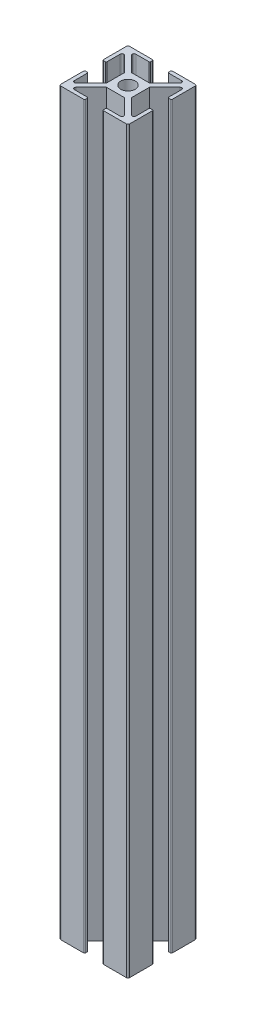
from build123d import *

# Parameters (mm, degrees)
BOSS_EXTRUDE1_DEPTH      = 215
FILLET1_R                = 0.5
FILLET2_R                = 0.25
CIRPATTERN1_COUNT        = 4
FILLET1_OF_CIRPATTERN1_R = 0.5
FILLET2_OF_CIRPATTERN1_R = 0.25
CUT_EXTRUDE1_DEPTH       = 217.159663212


with BuildPart() as part:
    # Sketch2 → Boss-Extrude1 (new body)
    with BuildSketch(Plane(origin=(0, 0, 0), x_dir=(1, 0, 0), z_dir=(0, 1, 0))):
        Polygon((10, 8.939339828), (8.939339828, 7.878679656), (8.939339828, 2.63), (10, 2.63), align=None)
        Polygon((5.995, 7.055660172), (2.599339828, 3.66), (3.66, 3.66), (3.66, 2.599339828), (8.939339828, 7.878679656), (8.939339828, 8.939339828), (7.878679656, 8.939339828), align=None)
        Polygon((8.939339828, 10), (7.878679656, 8.939339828), (8.939339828, 8.939339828), align=None)
        Polygon((10, 8.939339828), (8.939339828, 10), (8.939339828, 8.939339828), align=None)
        Polygon((10, 10), (8.939339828, 10), (10, 8.939339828), align=None)
        Polygon((8.939339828, 8.939339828), (8.939339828, 7.878679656), (10, 8.939339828), align=None)
        Polygon((5.995, 8.939339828), (7.878679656, 8.939339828), (8.939339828, 10), (2.63, 10), (2.63, 8.939339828), align=None)
        with BuildLine():
            Line((2.599339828, 3.66), (0.852877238, 1.913537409))
            ThreePointArc((0.852877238, 1.913537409), (1.481388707, 1.481388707), (1.913537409, 0.852877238))
            Line((1.913537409, 0.852877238), (3.66, 2.599339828))
            Line((3.66, 2.599339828), (3.66, 3.66))
            Line((3.66, 3.66), (2.599339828, 3.66))
        make_face()
        with BuildLine():
            Line((-0.852877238, -1.913537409), (-2.599339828, -3.66))
            Line((-2.599339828, -3.66), (3.66, -3.66))
            Line((3.66, -3.66), (3.66, 2.599339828))
            Line((3.66, 2.599339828), (1.913537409, 0.852877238))
            ThreePointArc((1.913537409, 0.852877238), (2.04913224, 0.435984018), (2.095, 0))
            ThreePointArc((2.095, 0), (1.140668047, -1.757242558), (-0.852877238, -1.913537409))
        make_face()
        with BuildLine():
            Line((-3.66, 3.66), (-3.66, -2.599339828))
            Line((-3.66, -2.599339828), (-1.913537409, -0.852877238))
            ThreePointArc((-1.913537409, -0.852877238), (-1.481388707, 1.481388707), (0.852877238, 1.913537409))
            Line((0.852877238, 1.913537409), (2.599339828, 3.66))
            Line((2.599339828, 3.66), (-3.66, 3.66))
        make_face()
        with BuildLine():
            Line((-1.913537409, -0.852877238), (-3.66, -2.599339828))
            Line((-3.66, -2.599339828), (-3.66, -3.66))
            Line((-3.66, -3.66), (-2.599339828, -3.66))
            Line((-2.599339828, -3.66), (-0.852877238, -1.913537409))
            ThreePointArc((-0.852877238, -1.913537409), (-1.481388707, -1.481388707), (-1.913537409, -0.852877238))
        make_face()
    boss_extrude1 = extrude(amount=BOSS_EXTRUDE1_DEPTH)

    # Fillet1
    fillet1_edges = [part.edges().sort_by_distance(p)[0] for p in [
        (8.939339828, 107.5, -7.878679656),
        (7.878679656, 107.5, -8.939339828),
        (10, 107.5, -10),
    ]]
    fillet(fillet1_edges, radius=FILLET1_R)

    # Fillet2
    fillet2_edges = [part.edges().sort_by_distance(p)[0] for p in [
        (10, 107.5, -2.63),
        (8.939339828, 107.5, -2.63),
        (2.63, 107.5, -8.939339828),
        (2.63, 107.5, -10),
    ]]
    fillet(fillet2_edges, radius=FILLET2_R)

    # CirPattern1: Boss-Extrude1 ×4 about axis
    cirpattern1_axis = Axis((0, 0, 0), (0, 1, 0))
    for i in range(1, CIRPATTERN1_COUNT):
        add(boss_extrude1.rotate(cirpattern1_axis, i * 360 / CIRPATTERN1_COUNT))

    # Fillet1 of CirPattern1
    fillet1_of_cirpattern1_edges = [part.edges().sort_by_distance(p)[0] for p in [
        (-7.878679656, 107.5, -8.939339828),
        (-8.939339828, 107.5, -7.878679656),
        (-10, 107.5, -10),
        (-8.939339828, 107.5, 7.878679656),
        (-7.878679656, 107.5, 8.939339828),
        (-10, 107.5, 10),
        (7.878679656, 107.5, 8.939339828),
        (8.939339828, 107.5, 7.878679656),
        (10, 107.5, 10),
    ]]
    fillet(fillet1_of_cirpattern1_edges, radius=FILLET1_OF_CIRPATTERN1_R)

    # Fillet2 of CirPattern1
    fillet2_of_cirpattern1_edges = [part.edges().sort_by_distance(p)[0] for p in [
        (-2.63, 107.5, -10),
        (-2.63, 107.5, -8.939339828),
        (-8.939339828, 107.5, -2.63),
        (-10, 107.5, -2.63),
        (-10, 107.5, 2.63),
        (-8.939339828, 107.5, 2.63),
        (-2.63, 107.5, 8.939339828),
        (-2.63, 107.5, 10),
        (2.63, 107.5, 10),
        (2.63, 107.5, 8.939339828),
        (8.939339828, 107.5, 2.63),
        (10, 107.5, 2.63),
    ]]
    fillet(fillet2_of_cirpattern1_edges, radius=FILLET2_OF_CIRPATTERN1_R)

    # Sketch3 → Cut-Extrude1 (cut, through all)
    with BuildSketch(Plane(origin=(10, 0, 0), x_dir=(0, 0, -1), z_dir=(1, 0, 0))):
        with BuildLine():
            Line((2.5025, 205.75), (2.5025, 200.75))
            ThreePointArc((2.5025, 200.75), (0.0025, 198.25), (-2.4975, 200.75))
            Line((-2.4975, 200.75), (-2.4975, 205.75))
            ThreePointArc((-2.4975, 205.75), (0.0025, 208.25), (2.5025, 205.75))
        make_face()
        with BuildLine():
            Line((2.5025, 9.25), (2.5025, 14.25))
            ThreePointArc((2.5025, 14.25), (0.0025, 16.75), (-2.4975, 14.25))
            Line((-2.4975, 14.25), (-2.4975, 9.25))
            ThreePointArc((-2.4975, 9.25), (0.0025, 6.75), (2.5025, 9.25))
        make_face()
    extrude(amount=-CUT_EXTRUDE1_DEPTH, mode=Mode.SUBTRACT)


solid = part.part
